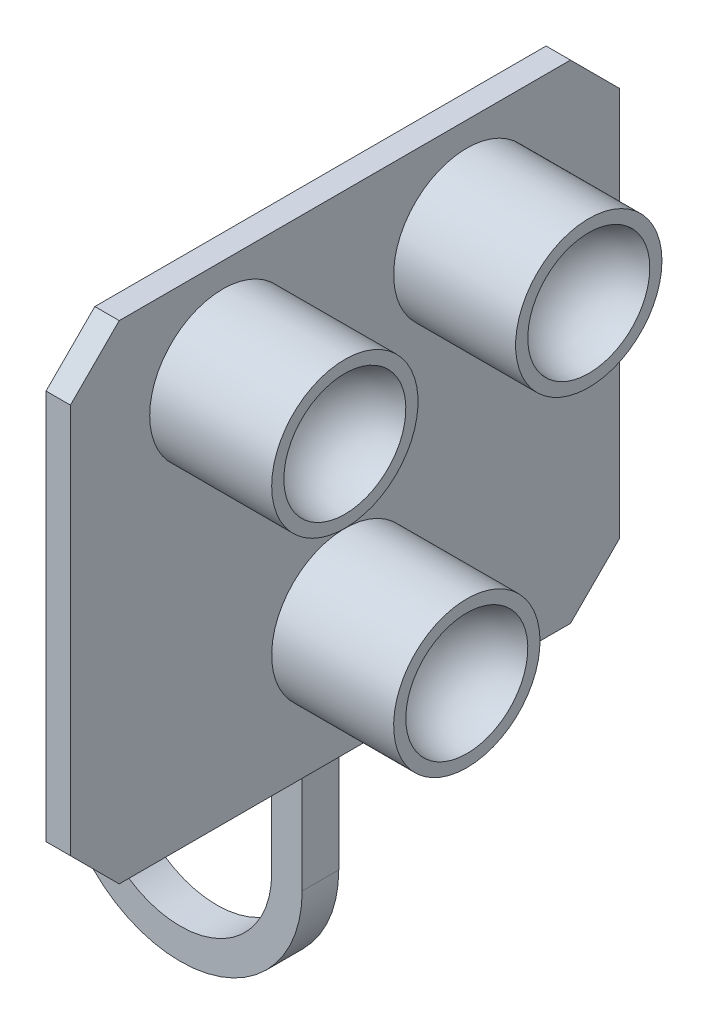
ISO-10303-21;
HEADER;
FILE_DESCRIPTION(('STEP AP214'),'2;1');
FILE_NAME('part.step','',(''),(''),'','','');
FILE_SCHEMA(('AUTOMOTIVE_DESIGN { 1 0 10303 214 1 1 1 1 }'));
ENDSEC;
DATA;
#1=APPLICATION_CONTEXT('core data for automotive mechanical design processes');
#2=APPLICATION_PROTOCOL_DEFINITION('international standard','automotive_design',2000,#1);
#3=PRODUCT_CONTEXT('',#1,'mechanical');
#4=PRODUCT('Part','Part','',(#3));
#5=PRODUCT_RELATED_PRODUCT_CATEGORY('part','',(#4));
#6=PRODUCT_DEFINITION_FORMATION('','',#4);
#7=PRODUCT_DEFINITION_CONTEXT('part definition',#1,'design');
#8=PRODUCT_DEFINITION('design','',#6,#7);
#9=PRODUCT_DEFINITION_SHAPE('','',#8);
#10=(LENGTH_UNIT() NAMED_UNIT(*) SI_UNIT(.MILLI.,.METRE.));
#11=(NAMED_UNIT(*) PLANE_ANGLE_UNIT() SI_UNIT($,.RADIAN.));
#12=(NAMED_UNIT(*) SI_UNIT($,.STERADIAN.) SOLID_ANGLE_UNIT());
#13=UNCERTAINTY_MEASURE_WITH_UNIT(LENGTH_MEASURE(1.E-05),#10,'distance_accuracy_value','');
#14=(GEOMETRIC_REPRESENTATION_CONTEXT(3) GLOBAL_UNCERTAINTY_ASSIGNED_CONTEXT((#13)) GLOBAL_UNIT_ASSIGNED_CONTEXT((#10,
#11,#12)) REPRESENTATION_CONTEXT('',''));
#15=CARTESIAN_POINT('',(0.,0.,0.));
#16=DIRECTION('',(0.,0.,1.));
#17=DIRECTION('',(1.,0.,0.));
#18=AXIS2_PLACEMENT_3D('',#15,#16,#17);
#19=CARTESIAN_POINT('',(-20.,400.000000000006,224.999999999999));
#20=DIRECTION('',(0.,0.,1.));
#21=DIRECTION('',(0.,-1.,0.));
#22=AXIS2_PLACEMENT_3D('',#19,#20,#21);
#23=PLANE('',#22);
#24=DIRECTION('',(0.,-1.,0.));
#25=VECTOR('',#24,1.);
#26=CARTESIAN_POINT('',(-20.,400.000000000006,224.999999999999));
#27=LINE('',#26,#25);
#28=CARTESIAN_POINT('',(-20.,360.000000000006,224.999999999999));
#29=VERTEX_POINT('',#28);
#30=CARTESIAN_POINT('',(-20.,40.,225.));
#31=VERTEX_POINT('',#30);
#32=EDGE_CURVE('E261',#29,#31,#27,.T.);
#33=ORIENTED_EDGE('',*,*,#32,.T.);
#34=DIRECTION('',(1.,0.,0.));
#35=VECTOR('',#34,1.);
#36=CARTESIAN_POINT('',(-20.,40.,225.));
#37=LINE('',#36,#35);
#38=CARTESIAN_POINT('',(0.,40.,225.));
#39=VERTEX_POINT('',#38);
#40=EDGE_CURVE('E308',#31,#39,#37,.T.);
#41=ORIENTED_EDGE('',*,*,#40,.T.);
#42=DIRECTION('',(0.,-1.,0.));
#43=VECTOR('',#42,1.);
#44=CARTESIAN_POINT('',(0.,400.000000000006,224.999999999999));
#45=LINE('',#44,#43);
#46=CARTESIAN_POINT('',(0.,360.000000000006,224.999999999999));
#47=VERTEX_POINT('',#46);
#48=EDGE_CURVE('E260',#47,#39,#45,.T.);
#49=ORIENTED_EDGE('',*,*,#48,.F.);
#50=DIRECTION('',(-1.,0.,0.));
#51=VECTOR('',#50,1.);
#52=CARTESIAN_POINT('',(-20.,360.000000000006,224.999999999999));
#53=LINE('',#52,#51);
#54=EDGE_CURVE('E305',#47,#29,#53,.T.);
#55=ORIENTED_EDGE('',*,*,#54,.T.);
#56=EDGE_LOOP('',(#33,#41,#49,#55));
#57=FACE_BOUND('',#56,.T.);
#58=ADVANCED_FACE('F38',(#57),#23,.T.);
#59=CARTESIAN_POINT('',(-20.,400.000000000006,224.999999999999));
#60=DIRECTION('',(0.,1.,0.));
#61=DIRECTION('',(0.,0.,1.));
#62=AXIS2_PLACEMENT_3D('',#59,#60,#61);
#63=PLANE('',#62);
#64=DIRECTION('',(0.,0.,1.));
#65=VECTOR('',#64,1.);
#66=CARTESIAN_POINT('',(-20.,400.000000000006,224.999999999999));
#67=LINE('',#66,#65);
#68=CARTESIAN_POINT('',(-20.,400.000000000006,-184.999999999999));
#69=VERTEX_POINT('',#68);
#70=CARTESIAN_POINT('',(-20.,400.000000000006,184.999999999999));
#71=VERTEX_POINT('',#70);
#72=EDGE_CURVE('E275',#69,#71,#67,.T.);
#73=ORIENTED_EDGE('',*,*,#72,.T.);
#74=DIRECTION('',(1.,0.,0.));
#75=VECTOR('',#74,1.);
#76=CARTESIAN_POINT('',(-20.,400.000000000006,184.999999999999));
#77=LINE('',#76,#75);
#78=CARTESIAN_POINT('',(0.,400.000000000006,184.999999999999));
#79=VERTEX_POINT('',#78);
#80=EDGE_CURVE('E346',#71,#79,#77,.T.);
#81=ORIENTED_EDGE('',*,*,#80,.T.);
#82=DIRECTION('',(0.,0.,1.));
#83=VECTOR('',#82,1.);
#84=CARTESIAN_POINT('',(0.,400.000000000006,224.999999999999));
#85=LINE('',#84,#83);
#86=CARTESIAN_POINT('',(0.,400.000000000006,-184.999999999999));
#87=VERTEX_POINT('',#86);
#88=EDGE_CURVE('E266',#87,#79,#85,.T.);
#89=ORIENTED_EDGE('',*,*,#88,.F.);
#90=DIRECTION('',(-1.,0.,0.));
#91=VECTOR('',#90,1.);
#92=CARTESIAN_POINT('',(-20.,400.000000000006,-184.999999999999));
#93=LINE('',#92,#91);
#94=EDGE_CURVE('E343',#87,#69,#93,.T.);
#95=ORIENTED_EDGE('',*,*,#94,.T.);
#96=EDGE_LOOP('',(#73,#81,#89,#95));
#97=FACE_BOUND('',#96,.T.);
#98=ADVANCED_FACE('F439',(#97),#63,.T.);
#99=CARTESIAN_POINT('',(-20.,400.000000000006,-224.999999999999));
#100=DIRECTION('',(0.,0.,-1.));
#101=DIRECTION('',(0.,1.,0.));
#102=AXIS2_PLACEMENT_3D('',#99,#100,#101);
#103=PLANE('',#102);
#104=DIRECTION('',(0.,1.,0.));
#105=VECTOR('',#104,1.);
#106=CARTESIAN_POINT('',(0.,400.000000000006,-224.999999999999));
#107=LINE('',#106,#105);
#108=CARTESIAN_POINT('',(0.,40.0000000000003,-225.));
#109=VERTEX_POINT('',#108);
#110=CARTESIAN_POINT('',(0.,360.000000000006,-224.999999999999));
#111=VERTEX_POINT('',#110);
#112=EDGE_CURVE('E287',#109,#111,#107,.T.);
#113=ORIENTED_EDGE('',*,*,#112,.F.);
#114=DIRECTION('',(-1.,0.,0.));
#115=VECTOR('',#114,1.);
#116=CARTESIAN_POINT('',(-20.,40.0000000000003,-225.));
#117=LINE('',#116,#115);
#118=CARTESIAN_POINT('',(-20.,40.0000000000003,-225.));
#119=VERTEX_POINT('',#118);
#120=EDGE_CURVE('E353',#109,#119,#117,.T.);
#121=ORIENTED_EDGE('',*,*,#120,.T.);
#122=DIRECTION('',(0.,1.,0.));
#123=VECTOR('',#122,1.);
#124=CARTESIAN_POINT('',(-20.,400.000000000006,-224.999999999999));
#125=LINE('',#124,#123);
#126=CARTESIAN_POINT('',(-20.,360.000000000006,-224.999999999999));
#127=VERTEX_POINT('',#126);
#128=EDGE_CURVE('E270',#119,#127,#125,.T.);
#129=ORIENTED_EDGE('',*,*,#128,.T.);
#130=DIRECTION('',(1.,0.,0.));
#131=VECTOR('',#130,1.);
#132=CARTESIAN_POINT('',(-20.,360.000000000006,-224.999999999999));
#133=LINE('',#132,#131);
#134=EDGE_CURVE('E349',#127,#111,#133,.T.);
#135=ORIENTED_EDGE('',*,*,#134,.T.);
#136=EDGE_LOOP('',(#113,#121,#129,#135));
#137=FACE_BOUND('',#136,.T.);
#138=ADVANCED_FACE('F442',(#137),#103,.T.);
#139=CARTESIAN_POINT('',(-20.,0.,225.));
#140=DIRECTION('',(0.,-1.,0.));
#141=DIRECTION('',(0.,0.,-1.));
#142=AXIS2_PLACEMENT_3D('',#139,#140,#141);
#143=PLANE('',#142);
#144=DIRECTION('',(0.,0.,-1.));
#145=VECTOR('',#144,1.);
#146=CARTESIAN_POINT('',(0.,0.,225.));
#147=LINE('',#146,#145);
#148=CARTESIAN_POINT('',(0.,0.,185.));
#149=VERTEX_POINT('',#148);
#150=CARTESIAN_POINT('',(0.,0.,-185.));
#151=VERTEX_POINT('',#150);
#152=EDGE_CURVE('E283',#149,#151,#147,.T.);
#153=ORIENTED_EDGE('',*,*,#152,.F.);
#154=DIRECTION('',(-1.,0.,0.));
#155=VECTOR('',#154,1.);
#156=CARTESIAN_POINT('',(-20.,0.,185.));
#157=LINE('',#156,#155);
#158=CARTESIAN_POINT('',(-20.,0.,185.));
#159=VERTEX_POINT('',#158);
#160=EDGE_CURVE('E328',#149,#159,#157,.T.);
#161=ORIENTED_EDGE('',*,*,#160,.T.);
#162=DIRECTION('',(0.,0.,-1.));
#163=VECTOR('',#162,1.);
#164=CARTESIAN_POINT('',(-20.,0.,225.));
#165=LINE('',#164,#163);
#166=CARTESIAN_POINT('',(-20.,0.,30.));
#167=VERTEX_POINT('',#166);
#168=EDGE_CURVE('E267',#159,#167,#165,.T.);
#169=ORIENTED_EDGE('',*,*,#168,.T.);
#170=CARTESIAN_POINT('',(-35.,0.,30.));
#171=DIRECTION('',(0.,-1.,0.));
#172=DIRECTION('',(0.,0.,-1.));
#173=AXIS2_PLACEMENT_3D('',#170,#171,#172);
#174=CIRCLE('',#173,15.);
#175=CARTESIAN_POINT('',(-35.,0.,15.));
#176=VERTEX_POINT('',#175);
#177=EDGE_CURVE('E53',#167,#176,#174,.F.);
#178=ORIENTED_EDGE('',*,*,#177,.T.);
#179=DIRECTION('',(-1.,0.,0.));
#180=VECTOR('',#179,1.);
#181=CARTESIAN_POINT('',(-20.,0.,15.));
#182=LINE('',#181,#180);
#183=CARTESIAN_POINT('',(-20.,0.,15.));
#184=VERTEX_POINT('',#183);
#185=EDGE_CURVE('E63',#184,#176,#182,.T.);
#186=ORIENTED_EDGE('',*,*,#185,.F.);
#187=CARTESIAN_POINT('',(-20.,0.,-15.));
#188=VERTEX_POINT('',#187);
#189=EDGE_CURVE('E271',#184,#188,#165,.T.);
#190=ORIENTED_EDGE('',*,*,#189,.T.);
#191=DIRECTION('',(1.,0.,0.));
#192=VECTOR('',#191,1.);
#193=CARTESIAN_POINT('',(-32.5,0.,-15.));
#194=LINE('',#193,#192);
#195=CARTESIAN_POINT('',(-35.,0.,-15.));
#196=VERTEX_POINT('',#195);
#197=EDGE_CURVE('E356',#196,#188,#194,.T.);
#198=ORIENTED_EDGE('',*,*,#197,.F.);
#199=CARTESIAN_POINT('',(-35.,0.,-30.));
#200=DIRECTION('',(0.,-1.,0.));
#201=DIRECTION('',(0.,0.,-1.));
#202=AXIS2_PLACEMENT_3D('',#199,#200,#201);
#203=CIRCLE('',#202,15.);
#204=CARTESIAN_POINT('',(-20.,0.,-30.));
#205=VERTEX_POINT('',#204);
#206=EDGE_CURVE('E375',#196,#205,#203,.F.);
#207=ORIENTED_EDGE('',*,*,#206,.T.);
#208=CARTESIAN_POINT('',(-20.,0.,-185.));
#209=VERTEX_POINT('',#208);
#210=EDGE_CURVE('E265',#205,#209,#165,.T.);
#211=ORIENTED_EDGE('',*,*,#210,.T.);
#212=DIRECTION('',(1.,0.,0.));
#213=VECTOR('',#212,1.);
#214=CARTESIAN_POINT('',(-20.,0.,-185.));
#215=LINE('',#214,#213);
#216=EDGE_CURVE('E324',#209,#151,#215,.T.);
#217=ORIENTED_EDGE('',*,*,#216,.T.);
#218=EDGE_LOOP('',(#153,#161,#169,#178,#186,#190,#198,#207,#211,#217));
#219=FACE_BOUND('',#218,.T.);
#220=ADVANCED_FACE('F434',(#219),#143,.T.);
#221=CARTESIAN_POINT('',(-20.,0.,0.));
#222=DIRECTION('',(1.,0.,0.));
#223=DIRECTION('',(0.,0.,-1.));
#224=AXIS2_PLACEMENT_3D('',#221,#222,#223);
#225=PLANE('',#224);
#226=ORIENTED_EDGE('',*,*,#210,.F.);
#227=DIRECTION('',(0.,-1.,0.));
#228=VECTOR('',#227,1.);
#229=CARTESIAN_POINT('',(-20.,360.000000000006,-30.));
#230=LINE('',#229,#228);
#231=CARTESIAN_POINT('',(-20.,360.000000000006,-30.));
#232=VERTEX_POINT('',#231);
#233=EDGE_CURVE('E367',#205,#232,#230,.F.);
#234=ORIENTED_EDGE('',*,*,#233,.T.);
#235=DIRECTION('',(0.,0.,-1.));
#236=VECTOR('',#235,1.);
#237=CARTESIAN_POINT('',(-20.,360.000000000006,15.));
#238=LINE('',#237,#236);
#239=CARTESIAN_POINT('',(-20.,360.000000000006,30.));
#240=VERTEX_POINT('',#239);
#241=EDGE_CURVE('E482',#240,#232,#238,.T.);
#242=ORIENTED_EDGE('',*,*,#241,.F.);
#243=DIRECTION('',(0.,-1.,0.));
#244=VECTOR('',#243,1.);
#245=CARTESIAN_POINT('',(-20.,0.,30.));
#246=LINE('',#245,#244);
#247=EDGE_CURVE('E363',#240,#167,#246,.T.);
#248=ORIENTED_EDGE('',*,*,#247,.T.);
#249=ORIENTED_EDGE('',*,*,#168,.F.);
#250=DIRECTION('',(0.,-0.707106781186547,-0.707106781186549));
#251=VECTOR('',#250,1.);
#252=CARTESIAN_POINT('',(-20.,40.,225.));
#253=LINE('',#252,#251);
#254=EDGE_CURVE('E340',#159,#31,#253,.F.);
#255=ORIENTED_EDGE('',*,*,#254,.T.);
#256=ORIENTED_EDGE('',*,*,#32,.F.);
#257=DIRECTION('',(0.,-0.707106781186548,0.707106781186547));
#258=VECTOR('',#257,1.);
#259=CARTESIAN_POINT('',(-20.,400.000000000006,184.999999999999));
#260=LINE('',#259,#258);
#261=EDGE_CURVE('E338',#29,#71,#260,.F.);
#262=ORIENTED_EDGE('',*,*,#261,.T.);
#263=ORIENTED_EDGE('',*,*,#72,.F.);
#264=DIRECTION('',(0.,0.707106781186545,0.70710678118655));
#265=VECTOR('',#264,1.);
#266=CARTESIAN_POINT('',(-20.,360.000000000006,-224.999999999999));
#267=LINE('',#266,#265);
#268=EDGE_CURVE('E331',#69,#127,#267,.F.);
#269=ORIENTED_EDGE('',*,*,#268,.T.);
#270=ORIENTED_EDGE('',*,*,#128,.F.);
#271=DIRECTION('',(0.,0.70710678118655,-0.707106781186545));
#272=VECTOR('',#271,1.);
#273=CARTESIAN_POINT('',(-20.,0.,-185.));
#274=LINE('',#273,#272);
#275=EDGE_CURVE('E334',#119,#209,#274,.F.);
#276=ORIENTED_EDGE('',*,*,#275,.T.);
#277=EDGE_LOOP('',(#226,#234,#242,#248,#249,#255,#256,#262,#263,#269,#270,#276));
#278=FACE_BOUND('',#277,.T.);
#279=ADVANCED_FACE('F431',(#278),#225,.F.);
#280=CARTESIAN_POINT('',(0.,0.,0.));
#281=DIRECTION('',(1.,0.,0.));
#282=DIRECTION('',(0.,0.,-1.));
#283=AXIS2_PLACEMENT_3D('',#280,#281,#282);
#284=PLANE('',#283);
#285=CARTESIAN_POINT('',(0.,320.,-100.));
#286=DIRECTION('',(1.,0.,0.));
#287=DIRECTION('',(0.,0.,-1.));
#288=AXIS2_PLACEMENT_3D('',#285,#286,#287);
#289=CIRCLE('',#288,60.);
#290=CARTESIAN_POINT('',(0.,320.,-160.));
#291=VERTEX_POINT('',#290);
#292=EDGE_CURVE('E301',#291,#291,#289,.T.);
#293=ORIENTED_EDGE('',*,*,#292,.F.);
#294=EDGE_LOOP('',(#293));
#295=FACE_BOUND('',#294,.T.);
#296=CARTESIAN_POINT('',(0.,320.,100.));
#297=DIRECTION('',(1.,0.,0.));
#298=DIRECTION('',(0.,0.,-1.));
#299=AXIS2_PLACEMENT_3D('',#296,#297,#298);
#300=CIRCLE('',#299,60.);
#301=CARTESIAN_POINT('',(0.,320.,40.));
#302=VERTEX_POINT('',#301);
#303=EDGE_CURVE('E297',#302,#302,#300,.T.);
#304=ORIENTED_EDGE('',*,*,#303,.F.);
#305=EDGE_LOOP('',(#304));
#306=FACE_BOUND('',#305,.T.);
#307=CARTESIAN_POINT('',(0.,100.,0.));
#308=DIRECTION('',(1.,0.,0.));
#309=DIRECTION('',(0.,0.,-1.));
#310=AXIS2_PLACEMENT_3D('',#307,#308,#309);
#311=CIRCLE('',#310,60.);
#312=CARTESIAN_POINT('',(0.,100.,-60.));
#313=VERTEX_POINT('',#312);
#314=EDGE_CURVE('E279',#313,#313,#311,.T.);
#315=ORIENTED_EDGE('',*,*,#314,.F.);
#316=EDGE_LOOP('',(#315));
#317=FACE_BOUND('',#316,.T.);
#318=ORIENTED_EDGE('',*,*,#48,.T.);
#319=DIRECTION('',(0.,0.707106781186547,0.707106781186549));
#320=VECTOR('',#319,1.);
#321=CARTESIAN_POINT('',(0.,-92.4999999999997,92.4999999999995));
#322=LINE('',#321,#320);
#323=EDGE_CURVE('E321',#39,#149,#322,.F.);
#324=ORIENTED_EDGE('',*,*,#323,.T.);
#325=ORIENTED_EDGE('',*,*,#152,.T.);
#326=DIRECTION('',(0.,-0.70710678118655,0.707106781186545));
#327=VECTOR('',#326,1.);
#328=CARTESIAN_POINT('',(0.,-92.4999999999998,-92.5000000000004));
#329=LINE('',#328,#327);
#330=EDGE_CURVE('E315',#151,#109,#329,.F.);
#331=ORIENTED_EDGE('',*,*,#330,.T.);
#332=ORIENTED_EDGE('',*,*,#112,.T.);
#333=DIRECTION('',(0.,-0.707106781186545,-0.70710678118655));
#334=VECTOR('',#333,1.);
#335=CARTESIAN_POINT('',(0.,292.500000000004,-292.500000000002));
#336=LINE('',#335,#334);
#337=EDGE_CURVE('E312',#111,#87,#336,.F.);
#338=ORIENTED_EDGE('',*,*,#337,.T.);
#339=ORIENTED_EDGE('',*,*,#88,.T.);
#340=DIRECTION('',(0.,0.707106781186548,-0.707106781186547));
#341=VECTOR('',#340,1.);
#342=CARTESIAN_POINT('',(0.,292.500000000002,292.500000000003));
#343=LINE('',#342,#341);
#344=EDGE_CURVE('E318',#79,#47,#343,.F.);
#345=ORIENTED_EDGE('',*,*,#344,.T.);
#346=EDGE_LOOP('',(#318,#324,#325,#331,#332,#338,#339,#345));
#347=FACE_BOUND('',#346,.T.);
#348=ADVANCED_FACE('F429',(#295,#306,#317,#347),#284,.T.);
#349=CARTESIAN_POINT('',(0.,100.,0.));
#350=DIRECTION('',(-1.,0.,0.));
#351=DIRECTION('',(0.,-1.,0.));
#352=AXIS2_PLACEMENT_3D('',#349,#350,#351);
#353=CYLINDRICAL_SURFACE('',#352,60.);
#354=CARTESIAN_POINT('',(100.,100.,0.));
#355=DIRECTION('',(-1.,0.,0.));
#356=DIRECTION('',(0.,-1.,0.));
#357=AXIS2_PLACEMENT_3D('',#354,#355,#356);
#358=CIRCLE('',#357,60.);
#359=CARTESIAN_POINT('',(100.,40.,0.));
#360=VERTEX_POINT('',#359);
#361=EDGE_CURVE('E256',#360,#360,#358,.T.);
#362=ORIENTED_EDGE('',*,*,#361,.T.);
#363=EDGE_LOOP('',(#362));
#364=FACE_BOUND('',#363,.T.);
#365=ORIENTED_EDGE('',*,*,#314,.T.);
#366=EDGE_LOOP('',(#365));
#367=FACE_BOUND('',#366,.T.);
#368=ADVANCED_FACE('F425',(#364,#367),#353,.T.);
#369=CARTESIAN_POINT('',(100.,50.,0.));
#370=DIRECTION('',(1.,0.,0.));
#371=DIRECTION('',(0.,1.,0.));
#372=AXIS2_PLACEMENT_3D('',#369,#370,#371);
#373=PLANE('',#372);
#374=CARTESIAN_POINT('',(100.,100.,0.));
#375=DIRECTION('',(-1.,0.,0.));
#376=DIRECTION('',(0.,-1.,0.));
#377=AXIS2_PLACEMENT_3D('',#374,#375,#376);
#378=CIRCLE('',#377,50.);
#379=CARTESIAN_POINT('',(100.,50.,0.));
#380=VERTEX_POINT('',#379);
#381=EDGE_CURVE('E252',#380,#380,#378,.T.);
#382=ORIENTED_EDGE('',*,*,#381,.T.);
#383=EDGE_LOOP('',(#382));
#384=FACE_BOUND('',#383,.T.);
#385=ORIENTED_EDGE('',*,*,#361,.F.);
#386=EDGE_LOOP('',(#385));
#387=FACE_BOUND('',#386,.T.);
#388=ADVANCED_FACE('F421',(#384,#387),#373,.T.);
#389=CARTESIAN_POINT('',(100.,100.,0.));
#390=DIRECTION('',(-1.,0.,0.));
#391=DIRECTION('',(0.,-1.,0.));
#392=AXIS2_PLACEMENT_3D('',#389,#390,#391);
#393=SPHERICAL_SURFACE('',#392,50.);
#394=ORIENTED_EDGE('',*,*,#381,.F.);
#395=EDGE_LOOP('',(#394));
#396=FACE_BOUND('',#395,.T.);
#397=ADVANCED_FACE('F417',(#396),#393,.F.);
#398=CARTESIAN_POINT('',(0.,320.,100.));
#399=DIRECTION('',(-1.,0.,0.));
#400=DIRECTION('',(0.,0.,1.));
#401=AXIS2_PLACEMENT_3D('',#398,#399,#400);
#402=CYLINDRICAL_SURFACE('',#401,60.);
#403=CARTESIAN_POINT('',(100.,320.,100.));
#404=DIRECTION('',(-1.,0.,0.));
#405=DIRECTION('',(0.,0.,1.));
#406=AXIS2_PLACEMENT_3D('',#403,#404,#405);
#407=CIRCLE('',#406,60.);
#408=CARTESIAN_POINT('',(100.,320.,160.));
#409=VERTEX_POINT('',#408);
#410=EDGE_CURVE('E248',#409,#409,#407,.T.);
#411=ORIENTED_EDGE('',*,*,#410,.T.);
#412=EDGE_LOOP('',(#411));
#413=FACE_BOUND('',#412,.T.);
#414=ORIENTED_EDGE('',*,*,#303,.T.);
#415=EDGE_LOOP('',(#414));
#416=FACE_BOUND('',#415,.T.);
#417=ADVANCED_FACE('F413',(#413,#416),#402,.T.);
#418=CARTESIAN_POINT('',(100.,270.,100.));
#419=DIRECTION('',(1.,0.,0.));
#420=DIRECTION('',(0.,0.,-1.));
#421=AXIS2_PLACEMENT_3D('',#418,#419,#420);
#422=PLANE('',#421);
#423=CARTESIAN_POINT('',(100.,320.,100.));
#424=DIRECTION('',(-1.,0.,0.));
#425=DIRECTION('',(0.,0.,1.));
#426=AXIS2_PLACEMENT_3D('',#423,#424,#425);
#427=CIRCLE('',#426,50.);
#428=CARTESIAN_POINT('',(100.,320.,150.));
#429=VERTEX_POINT('',#428);
#430=EDGE_CURVE('E244',#429,#429,#427,.T.);
#431=ORIENTED_EDGE('',*,*,#430,.T.);
#432=EDGE_LOOP('',(#431));
#433=FACE_BOUND('',#432,.T.);
#434=ORIENTED_EDGE('',*,*,#410,.F.);
#435=EDGE_LOOP('',(#434));
#436=FACE_BOUND('',#435,.T.);
#437=ADVANCED_FACE('F409',(#433,#436),#422,.T.);
#438=CARTESIAN_POINT('',(100.,320.,100.));
#439=DIRECTION('',(-1.,0.,0.));
#440=DIRECTION('',(0.,-1.,0.));
#441=AXIS2_PLACEMENT_3D('',#438,#439,#440);
#442=SPHERICAL_SURFACE('',#441,50.);
#443=ORIENTED_EDGE('',*,*,#430,.F.);
#444=EDGE_LOOP('',(#443));
#445=FACE_BOUND('',#444,.T.);
#446=ADVANCED_FACE('F405',(#445),#442,.F.);
#447=CARTESIAN_POINT('',(0.,320.,-100.));
#448=DIRECTION('',(-1.,0.,0.));
#449=DIRECTION('',(0.,0.,-1.));
#450=AXIS2_PLACEMENT_3D('',#447,#448,#449);
#451=CYLINDRICAL_SURFACE('',#450,60.);
#452=CARTESIAN_POINT('',(100.,320.,-100.));
#453=DIRECTION('',(1.,0.,0.));
#454=DIRECTION('',(0.,0.,-1.));
#455=AXIS2_PLACEMENT_3D('',#452,#453,#454);
#456=CIRCLE('',#455,60.);
#457=CARTESIAN_POINT('',(100.,320.,-160.));
#458=VERTEX_POINT('',#457);
#459=EDGE_CURVE('E234',#458,#458,#456,.T.);
#460=ORIENTED_EDGE('',*,*,#459,.F.);
#461=EDGE_LOOP('',(#460));
#462=FACE_BOUND('',#461,.T.);
#463=ORIENTED_EDGE('',*,*,#292,.T.);
#464=EDGE_LOOP('',(#463));
#465=FACE_BOUND('',#464,.T.);
#466=ADVANCED_FACE('F401',(#462,#465),#451,.T.);
#467=CARTESIAN_POINT('',(100.,270.,-100.));
#468=DIRECTION('',(1.,0.,0.));
#469=DIRECTION('',(0.,0.,1.));
#470=AXIS2_PLACEMENT_3D('',#467,#468,#469);
#471=PLANE('',#470);
#472=CARTESIAN_POINT('',(100.,320.,-100.));
#473=DIRECTION('',(1.,0.,0.));
#474=DIRECTION('',(0.,0.,-1.));
#475=AXIS2_PLACEMENT_3D('',#472,#473,#474);
#476=CIRCLE('',#475,50.);
#477=CARTESIAN_POINT('',(100.,320.,-150.));
#478=VERTEX_POINT('',#477);
#479=EDGE_CURVE('E228',#478,#478,#476,.T.);
#480=ORIENTED_EDGE('',*,*,#479,.F.);
#481=EDGE_LOOP('',(#480));
#482=FACE_BOUND('',#481,.T.);
#483=ORIENTED_EDGE('',*,*,#459,.T.);
#484=EDGE_LOOP('',(#483));
#485=FACE_BOUND('',#484,.T.);
#486=ADVANCED_FACE('F397',(#482,#485),#471,.T.);
#487=CARTESIAN_POINT('',(100.,320.,-100.));
#488=DIRECTION('',(-1.,0.,0.));
#489=DIRECTION('',(0.,-1.,0.));
#490=AXIS2_PLACEMENT_3D('',#487,#488,#489);
#491=SPHERICAL_SURFACE('',#490,50.);
#492=ORIENTED_EDGE('',*,*,#479,.T.);
#493=EDGE_LOOP('',(#492));
#494=FACE_BOUND('',#493,.T.);
#495=ADVANCED_FACE('F392',(#494),#491,.F.);
#496=CARTESIAN_POINT('',(-20.,40.,225.));
#497=DIRECTION('',(0.,0.707106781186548,-0.707106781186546));
#498=DIRECTION('',(1.,0.,0.));
#499=AXIS2_PLACEMENT_3D('',#496,#497,#498);
#500=PLANE('',#499);
#501=ORIENTED_EDGE('',*,*,#254,.F.);
#502=ORIENTED_EDGE('',*,*,#160,.F.);
#503=ORIENTED_EDGE('',*,*,#323,.F.);
#504=ORIENTED_EDGE('',*,*,#40,.F.);
#505=EDGE_LOOP('',(#501,#502,#503,#504));
#506=FACE_BOUND('',#505,.T.);
#507=ADVANCED_FACE('F396',(#506),#500,.F.);
#508=CARTESIAN_POINT('',(-20.,400.000000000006,184.999999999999));
#509=DIRECTION('',(0.,-0.707106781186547,-0.707106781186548));
#510=DIRECTION('',(1.,0.,0.));
#511=AXIS2_PLACEMENT_3D('',#508,#509,#510);
#512=PLANE('',#511);
#513=ORIENTED_EDGE('',*,*,#261,.F.);
#514=ORIENTED_EDGE('',*,*,#54,.F.);
#515=ORIENTED_EDGE('',*,*,#344,.F.);
#516=ORIENTED_EDGE('',*,*,#80,.F.);
#517=EDGE_LOOP('',(#513,#514,#515,#516));
#518=FACE_BOUND('',#517,.T.);
#519=ADVANCED_FACE('F454',(#518),#512,.F.);
#520=CARTESIAN_POINT('',(-20.,0.,-185.));
#521=DIRECTION('',(0.,0.707106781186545,0.70710678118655));
#522=DIRECTION('',(1.,0.,0.));
#523=AXIS2_PLACEMENT_3D('',#520,#521,#522);
#524=PLANE('',#523);
#525=ORIENTED_EDGE('',*,*,#275,.F.);
#526=ORIENTED_EDGE('',*,*,#120,.F.);
#527=ORIENTED_EDGE('',*,*,#330,.F.);
#528=ORIENTED_EDGE('',*,*,#216,.F.);
#529=EDGE_LOOP('',(#525,#526,#527,#528));
#530=FACE_BOUND('',#529,.T.);
#531=ADVANCED_FACE('F458',(#530),#524,.F.);
#532=CARTESIAN_POINT('',(-20.,360.000000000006,-224.999999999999));
#533=DIRECTION('',(0.,-0.70710678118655,0.707106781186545));
#534=DIRECTION('',(1.,0.,0.));
#535=AXIS2_PLACEMENT_3D('',#532,#533,#534);
#536=PLANE('',#535);
#537=ORIENTED_EDGE('',*,*,#268,.F.);
#538=ORIENTED_EDGE('',*,*,#94,.F.);
#539=ORIENTED_EDGE('',*,*,#337,.F.);
#540=ORIENTED_EDGE('',*,*,#134,.F.);
#541=EDGE_LOOP('',(#537,#538,#539,#540));
#542=FACE_BOUND('',#541,.T.);
#543=ADVANCED_FACE('F390',(#542),#536,.F.);
#544=CARTESIAN_POINT('',(-32.5,360.000000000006,15.));
#545=DIRECTION('',(0.,0.,-1.));
#546=DIRECTION('',(-1.,0.,0.));
#547=AXIS2_PLACEMENT_3D('',#544,#545,#546);
#548=CYLINDRICAL_SURFACE('',#547,12.5);
#549=ORIENTED_EDGE('',*,*,#241,.T.);
#550=CARTESIAN_POINT('',(-35.,372.247448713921,-15.));
#551=CARTESIAN_POINT('',(-34.8591396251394,372.276203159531,-14.9999983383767));
#552=CARTESIAN_POINT('',(-34.7178001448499,372.302520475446,-15.0019848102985));
#553=CARTESIAN_POINT('',(-34.4344103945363,372.350251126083,-15.0099966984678));
#554=CARTESIAN_POINT('',(-34.2923601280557,372.371664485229,-15.0160220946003));
#555=CARTESIAN_POINT('',(-33.8656674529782,372.428483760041,-15.0402418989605));
#556=CARTESIAN_POINT('',(-33.5803288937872,372.456500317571,-15.0645797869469));
#557=CARTESIAN_POINT('',(-33.0121330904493,372.492729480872,-15.1295703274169));
#558=CARTESIAN_POINT('',(-32.7292715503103,372.501065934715,-15.1701190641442));
#559=CARTESIAN_POINT('',(-32.1664039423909,372.49871639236,-15.2673054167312));
#560=CARTESIAN_POINT('',(-31.8863979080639,372.48803017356,-15.3239432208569));
#561=CARTESIAN_POINT('',(-31.3316028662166,372.44837852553,-15.4527016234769));
#562=CARTESIAN_POINT('',(-31.0568089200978,372.419431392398,-15.524806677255));
#563=CARTESIAN_POINT('',(-30.5138294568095,372.344241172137,-15.6837733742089));
#564=CARTESIAN_POINT('',(-30.2456469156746,372.297990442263,-15.7706415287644));
#565=CARTESIAN_POINT('',(-29.7172525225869,372.189304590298,-15.9582316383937));
#566=CARTESIAN_POINT('',(-29.4570487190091,372.126853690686,-16.0589670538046));
#567=CARTESIAN_POINT('',(-28.9460282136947,371.987055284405,-16.2731567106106));
#568=CARTESIAN_POINT('',(-28.6952134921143,371.90970465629,-16.3866136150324));
#569=CARTESIAN_POINT('',(-28.1266137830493,371.714946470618,-16.6626329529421));
#570=CARTESIAN_POINT('',(-27.8125620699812,371.592590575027,-16.8294201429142));
#571=CARTESIAN_POINT('',(-27.2035387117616,371.327308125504,-17.1805286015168));
#572=CARTESIAN_POINT('',(-26.90857223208,371.184376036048,-17.3648545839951));
#573=CARTESIAN_POINT('',(-26.338029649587,370.880474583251,-17.7489313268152));
#574=CARTESIAN_POINT('',(-26.0624801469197,370.719481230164,-17.9487024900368));
#575=CARTESIAN_POINT('',(-25.5314104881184,370.382088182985,-18.3613178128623));
#576=CARTESIAN_POINT('',(-25.2758913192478,370.205687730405,-18.5741626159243));
#577=CARTESIAN_POINT('',(-24.6931241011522,369.771362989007,-19.0925734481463));
#578=CARTESIAN_POINT('',(-24.3746583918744,369.507567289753,-19.4031187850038));
#579=CARTESIAN_POINT('',(-23.7743118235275,368.959776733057,-20.0412859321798));
#580=CARTESIAN_POINT('',(-23.4924439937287,368.675774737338,-20.3689137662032));
#581=CARTESIAN_POINT('',(-22.9637196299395,368.091041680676,-21.0384057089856));
#582=CARTESIAN_POINT('',(-22.7169210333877,367.790284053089,-21.3802921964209));
#583=CARTESIAN_POINT('',(-22.2576202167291,367.175710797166,-22.075028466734));
#584=CARTESIAN_POINT('',(-22.045117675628,366.86189529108,-22.427878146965));
#585=CARTESIAN_POINT('',(-21.5843728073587,366.111870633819,-23.2676930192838));
#586=CARTESIAN_POINT('',(-21.349736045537,365.671337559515,-23.7582916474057));
#587=CARTESIAN_POINT('',(-20.9380736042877,364.776456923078,-24.7510814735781));
#588=CARTESIAN_POINT('',(-20.7610725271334,364.322103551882,-25.2532775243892));
#589=CARTESIAN_POINT('',(-20.4629784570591,363.404748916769,-26.2646968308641));
#590=CARTESIAN_POINT('',(-20.3417978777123,362.941762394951,-26.7739077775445));
#591=CARTESIAN_POINT('',(-20.1535735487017,362.010325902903,-27.7968295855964));
#592=CARTESIAN_POINT('',(-20.0865047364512,361.541878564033,-28.3105382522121));
#593=CARTESIAN_POINT('',(-20.0158137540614,360.720763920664,-29.2104398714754));
#594=CARTESIAN_POINT('',(-20.000476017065,360.368612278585,-29.5962054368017));
#595=CARTESIAN_POINT('',(-20.0000036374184,360.011009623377,-29.9879395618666));
#596=CARTESIAN_POINT('',(-20.0000000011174,360.005504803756,-29.9939697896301));
#597=CARTESIAN_POINT('',(-20.,360.000000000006,-30.));
#598=B_SPLINE_CURVE_WITH_KNOTS('',3,(#550,#551,#552,#553,#554,#555,#556,#557,#558,#559,#560,
#561,#562,#563,#564,#565,#566,#567,#568,#569,#570,#571,#572,#573,#574,#575,#576,#577,#578,#579,
#580,#581,#582,#583,#584,#585,#586,#587,#588,#589,#590,#591,#592,#593,#594,#595,#596,#597),
.UNSPECIFIED.,.F.,.F.,(4,2,2,2,2,2,2,2,2,2,2,2,2,2,2,2,2,2,2,2,2,2,2,4),(0.,0.431223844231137,
0.862445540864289,1.72441829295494,2.58095196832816,3.43749566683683,4.29318253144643,
5.14924778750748,6.00614992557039,6.86323177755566,7.98974571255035,9.11656327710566,
10.2448956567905,11.3732836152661,12.9224376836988,14.4721417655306,16.0243770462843,
17.5765977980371,19.6732332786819,21.7707625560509,23.864989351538,25.9582456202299,
27.5249782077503,27.5494731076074),.UNSPECIFIED.);
#599=CARTESIAN_POINT('',(-35.,372.247448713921,-15.));
#600=VERTEX_POINT('',#599);
#601=EDGE_CURVE('E378',#232,#600,#598,.F.);
#602=ORIENTED_EDGE('',*,*,#601,.T.);
#603=CARTESIAN_POINT('',(-32.5,360.000000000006,-15.));
#604=DIRECTION('',(0.,0.,1.));
#605=DIRECTION('',(1.,0.,0.));
#606=AXIS2_PLACEMENT_3D('',#603,#604,#605);
#607=CIRCLE('',#606,12.5);
#608=CARTESIAN_POINT('',(-45.,360.000000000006,-15.));
#609=VERTEX_POINT('',#608);
#610=EDGE_CURVE('E225',#600,#609,#607,.T.);
#611=ORIENTED_EDGE('',*,*,#610,.T.);
#612=DIRECTION('',(0.,0.,-1.));
#613=VECTOR('',#612,1.);
#614=CARTESIAN_POINT('',(-45.,360.000000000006,15.));
#615=LINE('',#614,#613);
#616=CARTESIAN_POINT('',(-45.,360.000000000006,15.));
#617=VERTEX_POINT('',#616);
#618=EDGE_CURVE('E216',#617,#609,#615,.T.);
#619=ORIENTED_EDGE('',*,*,#618,.F.);
#620=CARTESIAN_POINT('',(-32.5,360.000000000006,15.));
#621=DIRECTION('',(0.,0.,1.));
#622=DIRECTION('',(1.,0.,0.));
#623=AXIS2_PLACEMENT_3D('',#620,#621,#622);
#624=CIRCLE('',#623,12.5);
#625=CARTESIAN_POINT('',(-35.,372.247448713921,15.));
#626=VERTEX_POINT('',#625);
#627=EDGE_CURVE('E200',#626,#617,#624,.T.);
#628=ORIENTED_EDGE('',*,*,#627,.F.);
#629=CARTESIAN_POINT('',(-35.,372.247448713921,15.));
#630=CARTESIAN_POINT('',(-34.8591396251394,372.276203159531,14.9999983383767));
#631=CARTESIAN_POINT('',(-34.7178001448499,372.302520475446,15.0019848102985));
#632=CARTESIAN_POINT('',(-34.4344103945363,372.350251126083,15.0099966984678));
#633=CARTESIAN_POINT('',(-34.2923601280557,372.371664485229,15.0160220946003));
#634=CARTESIAN_POINT('',(-33.8656674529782,372.428483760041,15.0402418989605));
#635=CARTESIAN_POINT('',(-33.5803288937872,372.456500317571,15.0645797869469));
#636=CARTESIAN_POINT('',(-33.0121330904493,372.492729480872,15.1295703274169));
#637=CARTESIAN_POINT('',(-32.7292715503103,372.501065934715,15.1701190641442));
#638=CARTESIAN_POINT('',(-32.1664039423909,372.49871639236,15.2673054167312));
#639=CARTESIAN_POINT('',(-31.8863979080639,372.48803017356,15.3239432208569));
#640=CARTESIAN_POINT('',(-31.3316028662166,372.44837852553,15.4527016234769));
#641=CARTESIAN_POINT('',(-31.0568089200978,372.419431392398,15.524806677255));
#642=CARTESIAN_POINT('',(-30.5138294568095,372.344241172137,15.6837733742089));
#643=CARTESIAN_POINT('',(-30.2456469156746,372.297990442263,15.7706415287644));
#644=CARTESIAN_POINT('',(-29.7172525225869,372.189304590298,15.9582316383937));
#645=CARTESIAN_POINT('',(-29.4570487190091,372.126853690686,16.0589670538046));
#646=CARTESIAN_POINT('',(-28.9460282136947,371.987055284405,16.2731567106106));
#647=CARTESIAN_POINT('',(-28.6952134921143,371.90970465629,16.3866136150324));
#648=CARTESIAN_POINT('',(-28.1266137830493,371.714946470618,16.6626329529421));
#649=CARTESIAN_POINT('',(-27.8125620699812,371.592590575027,16.8294201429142));
#650=CARTESIAN_POINT('',(-27.2035387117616,371.327308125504,17.1805286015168));
#651=CARTESIAN_POINT('',(-26.90857223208,371.184376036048,17.3648545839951));
#652=CARTESIAN_POINT('',(-26.338029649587,370.880474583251,17.7489313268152));
#653=CARTESIAN_POINT('',(-26.0624801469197,370.719481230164,17.9487024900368));
#654=CARTESIAN_POINT('',(-25.5314104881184,370.382088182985,18.3613178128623));
#655=CARTESIAN_POINT('',(-25.2758913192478,370.205687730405,18.5741626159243));
#656=CARTESIAN_POINT('',(-24.6931241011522,369.771362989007,19.0925734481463));
#657=CARTESIAN_POINT('',(-24.3746583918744,369.507567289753,19.4031187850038));
#658=CARTESIAN_POINT('',(-23.7743118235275,368.959776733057,20.0412859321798));
#659=CARTESIAN_POINT('',(-23.4924439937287,368.675774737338,20.3689137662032));
#660=CARTESIAN_POINT('',(-22.9637196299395,368.091041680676,21.0384057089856));
#661=CARTESIAN_POINT('',(-22.7169210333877,367.790284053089,21.3802921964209));
#662=CARTESIAN_POINT('',(-22.2576202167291,367.175710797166,22.075028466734));
#663=CARTESIAN_POINT('',(-22.045117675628,366.86189529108,22.427878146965));
#664=CARTESIAN_POINT('',(-21.5843728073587,366.111870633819,23.2676930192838));
#665=CARTESIAN_POINT('',(-21.349736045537,365.671337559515,23.7582916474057));
#666=CARTESIAN_POINT('',(-20.9380736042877,364.776456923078,24.7510814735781));
#667=CARTESIAN_POINT('',(-20.7610725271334,364.322103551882,25.2532775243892));
#668=CARTESIAN_POINT('',(-20.4629784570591,363.404748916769,26.2646968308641));
#669=CARTESIAN_POINT('',(-20.3417978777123,362.941762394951,26.7739077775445));
#670=CARTESIAN_POINT('',(-20.1535735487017,362.010325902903,27.7968295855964));
#671=CARTESIAN_POINT('',(-20.0865047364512,361.541878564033,28.3105382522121));
#672=CARTESIAN_POINT('',(-20.0158137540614,360.720763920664,29.2104398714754));
#673=CARTESIAN_POINT('',(-20.000476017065,360.368612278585,29.5962054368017));
#674=CARTESIAN_POINT('',(-20.0000036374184,360.011009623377,29.9879395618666));
#675=CARTESIAN_POINT('',(-20.0000000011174,360.005504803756,29.9939697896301));
#676=CARTESIAN_POINT('',(-20.,360.000000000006,30.));
#677=B_SPLINE_CURVE_WITH_KNOTS('',3,(#629,#630,#631,#632,#633,#634,#635,#636,#637,#638,#639,
#640,#641,#642,#643,#644,#645,#646,#647,#648,#649,#650,#651,#652,#653,#654,#655,#656,#657,#658,
#659,#660,#661,#662,#663,#664,#665,#666,#667,#668,#669,#670,#671,#672,#673,#674,#675,#676),
.UNSPECIFIED.,.F.,.F.,(4,2,2,2,2,2,2,2,2,2,2,2,2,2,2,2,2,2,2,2,2,2,2,4),(0.,0.431223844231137,
0.862445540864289,1.72441829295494,2.58095196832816,3.43749566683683,4.29318253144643,
5.14924778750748,6.00614992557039,6.86323177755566,7.98974571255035,9.11656327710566,
10.2448956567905,11.3732836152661,12.9224376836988,14.4721417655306,16.0243770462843,
17.5765977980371,19.6732332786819,21.7707625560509,23.864989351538,25.9582456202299,
27.5249782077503,27.5494731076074),.UNSPECIFIED.);
#678=EDGE_CURVE('E11',#626,#240,#677,.T.);
#679=ORIENTED_EDGE('',*,*,#678,.T.);
#680=EDGE_LOOP('',(#549,#602,#611,#619,#628,#679));
#681=FACE_BOUND('',#680,.T.);
#682=ADVANCED_FACE('F223',(#681),#548,.T.);
#683=CARTESIAN_POINT('',(-45.,360.000000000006,15.));
#684=DIRECTION('',(1.,0.,0.));
#685=DIRECTION('',(0.,1.,0.));
#686=AXIS2_PLACEMENT_3D('',#683,#684,#685);
#687=PLANE('',#686);
#688=DIRECTION('',(0.,-1.,0.));
#689=VECTOR('',#688,1.);
#690=CARTESIAN_POINT('',(-45.,360.000000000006,-15.));
#691=LINE('',#690,#689);
#692=CARTESIAN_POINT('',(-45.,-100.,-15.));
#693=VERTEX_POINT('',#692);
#694=EDGE_CURVE('E486',#609,#693,#691,.T.);
#695=ORIENTED_EDGE('',*,*,#694,.T.);
#696=DIRECTION('',(0.,0.,-1.));
#697=VECTOR('',#696,1.);
#698=CARTESIAN_POINT('',(-45.,-100.,15.));
#699=LINE('',#698,#697);
#700=CARTESIAN_POINT('',(-45.,-100.,15.));
#701=VERTEX_POINT('',#700);
#702=EDGE_CURVE('E218',#701,#693,#699,.T.);
#703=ORIENTED_EDGE('',*,*,#702,.F.);
#704=DIRECTION('',(0.,-1.,0.));
#705=VECTOR('',#704,1.);
#706=CARTESIAN_POINT('',(-45.,360.000000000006,15.));
#707=LINE('',#706,#705);
#708=EDGE_CURVE('E203',#617,#701,#707,.T.);
#709=ORIENTED_EDGE('',*,*,#708,.F.);
#710=ORIENTED_EDGE('',*,*,#618,.T.);
#711=EDGE_LOOP('',(#695,#703,#709,#710));
#712=FACE_BOUND('',#711,.T.);
#713=ADVANCED_FACE('F215',(#712),#687,.F.);
#714=CARTESIAN_POINT('',(-120.,-100.,15.));
#715=DIRECTION('',(0.,0.,-1.));
#716=DIRECTION('',(-1.,0.,0.));
#717=AXIS2_PLACEMENT_3D('',#714,#715,#716);
#718=CYLINDRICAL_SURFACE('',#717,75.);
#719=CARTESIAN_POINT('',(-120.,-100.,-15.));
#720=DIRECTION('',(0.,0.,-1.));
#721=DIRECTION('',(-1.,0.,0.));
#722=AXIS2_PLACEMENT_3D('',#719,#720,#721);
#723=CIRCLE('',#722,75.);
#724=CARTESIAN_POINT('',(-195.,-100.,-15.));
#725=VERTEX_POINT('',#724);
#726=EDGE_CURVE('E489',#693,#725,#723,.T.);
#727=ORIENTED_EDGE('',*,*,#726,.T.);
#728=DIRECTION('',(0.,0.,-1.));
#729=VECTOR('',#728,1.);
#730=CARTESIAN_POINT('',(-195.,-100.,15.));
#731=LINE('',#730,#729);
#732=CARTESIAN_POINT('',(-195.,-100.,15.));
#733=VERTEX_POINT('',#732);
#734=EDGE_CURVE('E237',#733,#725,#731,.T.);
#735=ORIENTED_EDGE('',*,*,#734,.F.);
#736=CARTESIAN_POINT('',(-120.,-100.,15.));
#737=DIRECTION('',(0.,0.,-1.));
#738=DIRECTION('',(-1.,0.,0.));
#739=AXIS2_PLACEMENT_3D('',#736,#737,#738);
#740=CIRCLE('',#739,75.);
#741=EDGE_CURVE('E221',#701,#733,#740,.T.);
#742=ORIENTED_EDGE('',*,*,#741,.F.);
#743=ORIENTED_EDGE('',*,*,#702,.T.);
#744=EDGE_LOOP('',(#727,#735,#742,#743));
#745=FACE_BOUND('',#744,.T.);
#746=ADVANCED_FACE('F542',(#745),#718,.F.);
#747=CARTESIAN_POINT('',(-207.5,-100.,15.));
#748=DIRECTION('',(0.,0.,-1.));
#749=DIRECTION('',(-1.,0.,0.));
#750=AXIS2_PLACEMENT_3D('',#747,#748,#749);
#751=CYLINDRICAL_SURFACE('',#750,12.5);
#752=CARTESIAN_POINT('',(-207.5,-100.,-15.));
#753=DIRECTION('',(0.,0.,1.));
#754=DIRECTION('',(-1.,0.,0.));
#755=AXIS2_PLACEMENT_3D('',#752,#753,#754);
#756=CIRCLE('',#755,12.5);
#757=CARTESIAN_POINT('',(-220.,-100.,-15.));
#758=VERTEX_POINT('',#757);
#759=EDGE_CURVE('E497',#725,#758,#756,.T.);
#760=ORIENTED_EDGE('',*,*,#759,.T.);
#761=DIRECTION('',(0.,0.,-1.));
#762=VECTOR('',#761,1.);
#763=CARTESIAN_POINT('',(-220.,-100.,15.));
#764=LINE('',#763,#762);
#765=CARTESIAN_POINT('',(-220.,-100.,15.));
#766=VERTEX_POINT('',#765);
#767=EDGE_CURVE('E512',#766,#758,#764,.T.);
#768=ORIENTED_EDGE('',*,*,#767,.F.);
#769=CARTESIAN_POINT('',(-207.5,-100.,15.));
#770=DIRECTION('',(0.,0.,1.));
#771=DIRECTION('',(-1.,0.,0.));
#772=AXIS2_PLACEMENT_3D('',#769,#770,#771);
#773=CIRCLE('',#772,12.5);
#774=EDGE_CURVE('E524',#733,#766,#773,.T.);
#775=ORIENTED_EDGE('',*,*,#774,.F.);
#776=ORIENTED_EDGE('',*,*,#734,.T.);
#777=EDGE_LOOP('',(#760,#768,#775,#776));
#778=FACE_BOUND('',#777,.T.);
#779=ADVANCED_FACE('F522',(#778),#751,.T.);
#780=CARTESIAN_POINT('',(-120.,-100.,15.));
#781=DIRECTION('',(0.,0.,-1.));
#782=DIRECTION('',(-1.,0.,0.));
#783=AXIS2_PLACEMENT_3D('',#780,#781,#782);
#784=CYLINDRICAL_SURFACE('',#783,100.);
#785=CARTESIAN_POINT('',(-120.,-100.,-15.));
#786=DIRECTION('',(0.,0.,1.));
#787=DIRECTION('',(-1.,0.,0.));
#788=AXIS2_PLACEMENT_3D('',#785,#786,#787);
#789=CIRCLE('',#788,100.);
#790=CARTESIAN_POINT('',(-19.9999999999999,-100.,-15.));
#791=VERTEX_POINT('',#790);
#792=EDGE_CURVE('E500',#758,#791,#789,.T.);
#793=ORIENTED_EDGE('',*,*,#792,.T.);
#794=DIRECTION('',(0.,0.,-1.));
#795=VECTOR('',#794,1.);
#796=CARTESIAN_POINT('',(-19.9999999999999,-100.,15.));
#797=LINE('',#796,#795);
#798=CARTESIAN_POINT('',(-19.9999999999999,-100.,15.));
#799=VERTEX_POINT('',#798);
#800=EDGE_CURVE('E508',#799,#791,#797,.T.);
#801=ORIENTED_EDGE('',*,*,#800,.F.);
#802=CARTESIAN_POINT('',(-120.,-100.,15.));
#803=DIRECTION('',(0.,0.,1.));
#804=DIRECTION('',(-1.,0.,0.));
#805=AXIS2_PLACEMENT_3D('',#802,#803,#804);
#806=CIRCLE('',#805,100.);
#807=EDGE_CURVE('E537',#766,#799,#806,.T.);
#808=ORIENTED_EDGE('',*,*,#807,.F.);
#809=ORIENTED_EDGE('',*,*,#767,.T.);
#810=EDGE_LOOP('',(#793,#801,#808,#809));
#811=FACE_BOUND('',#810,.T.);
#812=ADVANCED_FACE('F530',(#811),#784,.T.);
#813=CARTESIAN_POINT('',(-20.,360.000000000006,15.));
#814=DIRECTION('',(-1.,0.,0.));
#815=DIRECTION('',(0.,-1.,0.));
#816=AXIS2_PLACEMENT_3D('',#813,#814,#815);
#817=PLANE('',#816);
#818=ORIENTED_EDGE('',*,*,#189,.F.);
#819=DIRECTION('',(0.,1.,0.));
#820=VECTOR('',#819,1.);
#821=CARTESIAN_POINT('',(-20.,360.000000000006,15.));
#822=LINE('',#821,#820);
#823=EDGE_CURVE('E492',#799,#184,#822,.T.);
#824=ORIENTED_EDGE('',*,*,#823,.F.);
#825=ORIENTED_EDGE('',*,*,#800,.T.);
#826=DIRECTION('',(0.,1.,0.));
#827=VECTOR('',#826,1.);
#828=CARTESIAN_POINT('',(-20.,360.000000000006,-15.));
#829=LINE('',#828,#827);
#830=EDGE_CURVE('E211',#791,#188,#829,.T.);
#831=ORIENTED_EDGE('',*,*,#830,.T.);
#832=EDGE_LOOP('',(#818,#824,#825,#831));
#833=FACE_BOUND('',#832,.T.);
#834=ADVANCED_FACE('F535',(#833),#817,.F.);
#835=CARTESIAN_POINT('',(-32.5,360.000000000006,15.));
#836=DIRECTION('',(0.,0.,1.));
#837=DIRECTION('',(1.,0.,0.));
#838=AXIS2_PLACEMENT_3D('',#835,#836,#837);
#839=PLANE('',#838);
#840=ORIENTED_EDGE('',*,*,#823,.T.);
#841=ORIENTED_EDGE('',*,*,#185,.T.);
#842=DIRECTION('',(0.,-1.,0.));
#843=VECTOR('',#842,1.);
#844=CARTESIAN_POINT('',(-35.,360.000000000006,15.));
#845=LINE('',#844,#843);
#846=EDGE_CURVE('E206',#176,#626,#845,.F.);
#847=ORIENTED_EDGE('',*,*,#846,.T.);
#848=ORIENTED_EDGE('',*,*,#627,.T.);
#849=ORIENTED_EDGE('',*,*,#708,.T.);
#850=ORIENTED_EDGE('',*,*,#741,.T.);
#851=ORIENTED_EDGE('',*,*,#774,.T.);
#852=ORIENTED_EDGE('',*,*,#807,.T.);
#853=EDGE_LOOP('',(#840,#841,#847,#848,#849,#850,#851,#852));
#854=FACE_BOUND('',#853,.T.);
#855=ADVANCED_FACE('F202',(#854),#839,.T.);
#856=CARTESIAN_POINT('',(-32.5,360.000000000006,-15.));
#857=DIRECTION('',(0.,0.,1.));
#858=DIRECTION('',(1.,0.,0.));
#859=AXIS2_PLACEMENT_3D('',#856,#857,#858);
#860=PLANE('',#859);
#861=ORIENTED_EDGE('',*,*,#610,.F.);
#862=DIRECTION('',(0.,-1.,0.));
#863=VECTOR('',#862,1.);
#864=CARTESIAN_POINT('',(-35.,0.,-15.));
#865=LINE('',#864,#863);
#866=EDGE_CURVE('E359',#600,#196,#865,.T.);
#867=ORIENTED_EDGE('',*,*,#866,.T.);
#868=ORIENTED_EDGE('',*,*,#197,.T.);
#869=ORIENTED_EDGE('',*,*,#830,.F.);
#870=ORIENTED_EDGE('',*,*,#792,.F.);
#871=ORIENTED_EDGE('',*,*,#759,.F.);
#872=ORIENTED_EDGE('',*,*,#726,.F.);
#873=ORIENTED_EDGE('',*,*,#694,.F.);
#874=EDGE_LOOP('',(#861,#867,#868,#869,#870,#871,#872,#873));
#875=FACE_BOUND('',#874,.T.);
#876=ADVANCED_FACE('F484',(#875),#860,.F.);
#877=CARTESIAN_POINT('',(-35.,360.000000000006,-30.));
#878=DIRECTION('',(0.,1.,0.));
#879=DIRECTION('',(0.,0.,1.));
#880=AXIS2_PLACEMENT_3D('',#877,#878,#879);
#881=CYLINDRICAL_SURFACE('',#880,15.);
#882=ORIENTED_EDGE('',*,*,#601,.F.);
#883=ORIENTED_EDGE('',*,*,#233,.F.);
#884=ORIENTED_EDGE('',*,*,#206,.F.);
#885=ORIENTED_EDGE('',*,*,#866,.F.);
#886=EDGE_LOOP('',(#882,#883,#884,#885));
#887=FACE_BOUND('',#886,.T.);
#888=ADVANCED_FACE('F383',(#887),#881,.F.);
#889=CARTESIAN_POINT('',(-35.,0.,30.));
#890=DIRECTION('',(0.,-1.,0.));
#891=DIRECTION('',(0.,0.,-1.));
#892=AXIS2_PLACEMENT_3D('',#889,#890,#891);
#893=CYLINDRICAL_SURFACE('',#892,15.);
#894=ORIENTED_EDGE('',*,*,#678,.F.);
#895=ORIENTED_EDGE('',*,*,#846,.F.);
#896=ORIENTED_EDGE('',*,*,#177,.F.);
#897=ORIENTED_EDGE('',*,*,#247,.F.);
#898=EDGE_LOOP('',(#894,#895,#896,#897));
#899=FACE_BOUND('',#898,.T.);
#900=ADVANCED_FACE('F40',(#899),#893,.F.);
#901=CLOSED_SHELL('',(#58,#98,#138,#220,#279,#348,#368,#388,#397,#417,#437,#446,#466,#486,#495,
#507,#519,#531,#543,#682,#713,#746,#779,#812,#834,#855,#876,#888,#900));
#902=MANIFOLD_SOLID_BREP('B2',#901);
#903=ADVANCED_BREP_SHAPE_REPRESENTATION('',(#18,#902),#14);
#904=SHAPE_DEFINITION_REPRESENTATION(#9,#903);
ENDSEC;
END-ISO-10303-21;
